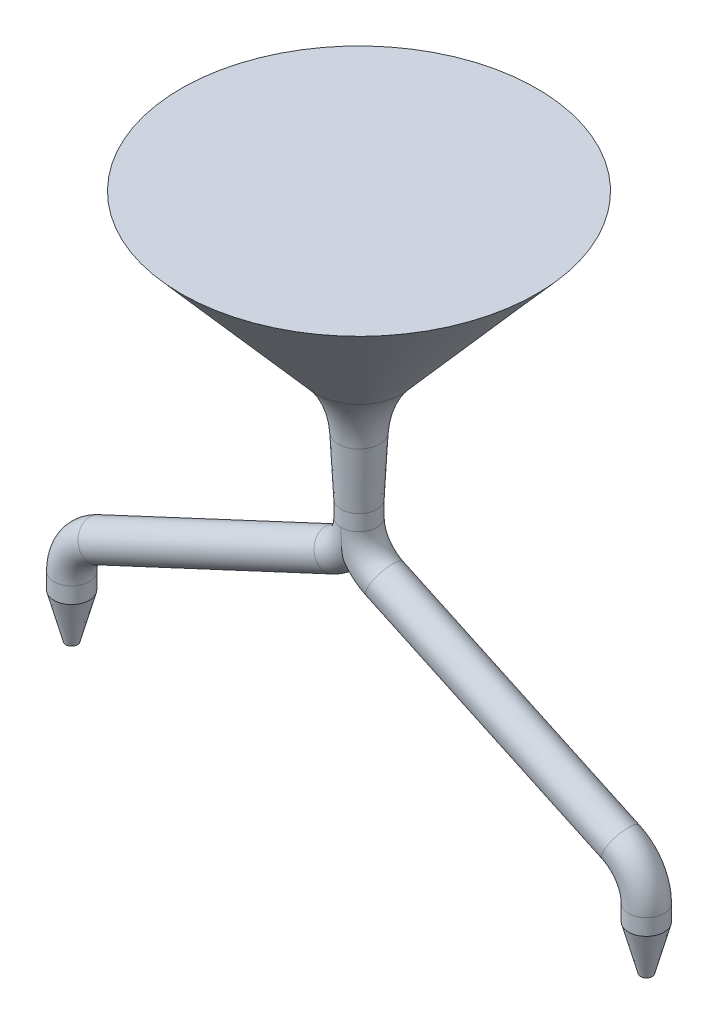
ISO-10303-21;
HEADER;
FILE_DESCRIPTION(('STEP AP214'),'2;1');
FILE_NAME('part.step','',(''),(''),'','','');
FILE_SCHEMA(('AUTOMOTIVE_DESIGN { 1 0 10303 214 1 1 1 1 }'));
ENDSEC;
DATA;
#1=APPLICATION_CONTEXT('core data for automotive mechanical design processes');
#2=APPLICATION_PROTOCOL_DEFINITION('international standard','automotive_design',2000,#1);
#3=PRODUCT_CONTEXT('',#1,'mechanical');
#4=PRODUCT('Part','Part','',(#3));
#5=PRODUCT_RELATED_PRODUCT_CATEGORY('part','',(#4));
#6=PRODUCT_DEFINITION_FORMATION('','',#4);
#7=PRODUCT_DEFINITION_CONTEXT('part definition',#1,'design');
#8=PRODUCT_DEFINITION('design','',#6,#7);
#9=PRODUCT_DEFINITION_SHAPE('','',#8);
#10=(LENGTH_UNIT() NAMED_UNIT(*) SI_UNIT(.MILLI.,.METRE.));
#11=(NAMED_UNIT(*) PLANE_ANGLE_UNIT() SI_UNIT($,.RADIAN.));
#12=(NAMED_UNIT(*) SI_UNIT($,.STERADIAN.) SOLID_ANGLE_UNIT());
#13=UNCERTAINTY_MEASURE_WITH_UNIT(LENGTH_MEASURE(1.E-05),#10,'distance_accuracy_value','');
#14=(GEOMETRIC_REPRESENTATION_CONTEXT(3) GLOBAL_UNCERTAINTY_ASSIGNED_CONTEXT((#13)) GLOBAL_UNIT_ASSIGNED_CONTEXT((#10,
#11,#12)) REPRESENTATION_CONTEXT('',''));
#15=CARTESIAN_POINT('',(0.,0.,0.));
#16=DIRECTION('',(0.,0.,1.));
#17=DIRECTION('',(1.,0.,0.));
#18=AXIS2_PLACEMENT_3D('',#15,#16,#17);
#19=CARTESIAN_POINT('',(5.,-1.74824826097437,0.));
#20=DIRECTION('',(0.,0.,-1.));
#21=DIRECTION('',(-1.,0.,0.));
#22=AXIS2_PLACEMENT_3D('',#19,#20,#21);
#23=TOROIDAL_SURFACE('',#22,5.,2.);
#24=CARTESIAN_POINT('',(2.88690869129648,-6.27978719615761,0.));
#25=DIRECTION('',(0.906307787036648,-0.422618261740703,0.));
#26=DIRECTION('',(0.,0.,-1.));
#27=AXIS2_PLACEMENT_3D('',#24,#25,#26);
#28=CIRCLE('',#27,2.);
#29=CARTESIAN_POINT('',(2.88690869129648,-6.27978719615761,-2.));
#30=VERTEX_POINT('',#29);
#31=EDGE_CURVE('E66',#30,#30,#28,.T.);
#32=ORIENTED_EDGE('',*,*,#31,.F.);
#33=EDGE_LOOP('',(#32));
#34=FACE_BOUND('',#33,.T.);
#35=CARTESIAN_POINT('',(0.,-1.74824826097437,-2.));
#36=CARTESIAN_POINT('',(0.,-1.76491263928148,-2.00000007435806));
#37=CARTESIAN_POINT('',(0.,-1.78157701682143,-2.00000004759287));
#38=CARTESIAN_POINT('',(0.,-1.81491034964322,-1.99999992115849));
#39=CARTESIAN_POINT('',(0.,-1.83157930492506,-1.99999982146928));
#40=CARTESIAN_POINT('',(0.,-1.94622306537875,-1.99999933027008));
#41=CARTESIAN_POINT('',(0.,-2.04419789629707,-1.99999988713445));
#42=CARTESIAN_POINT('',(0.,-2.24014772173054,-1.99988008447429));
#43=CARTESIAN_POINT('',(0.,-2.33812271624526,-1.99975972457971));
#44=CARTESIAN_POINT('',(0.,-2.53410329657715,-1.99913119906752));
#45=CARTESIAN_POINT('',(0.,-2.63210888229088,-1.99862291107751));
#46=CARTESIAN_POINT('',(0.,-2.82811225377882,-1.99681498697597));
#47=CARTESIAN_POINT('',(0.,-2.92611003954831,-1.99551535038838));
#48=CARTESIAN_POINT('',(0.,-3.21978547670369,-1.98969301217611));
#49=CARTESIAN_POINT('',(0.,-3.41543836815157,-1.98324875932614));
#50=CARTESIAN_POINT('',(0.,-3.80608736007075,-1.96002484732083));
#51=CARTESIAN_POINT('',(0.,-4.00108387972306,-1.94325405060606));
#52=CARTESIAN_POINT('',(0.,-4.36222322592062,-1.8963607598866));
#53=CARTESIAN_POINT('',(0.,-4.52863102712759,-1.86840257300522));
#54=CARTESIAN_POINT('',(0.,-4.8581324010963,-1.79510890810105));
#55=CARTESIAN_POINT('',(0.,-5.02122030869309,-1.74974598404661));
#56=CARTESIAN_POINT('',(0.,-5.26114853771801,-1.66435928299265));
#57=CARTESIAN_POINT('',(0.,-5.34094957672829,-1.63268693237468));
#58=CARTESIAN_POINT('',(0.,-5.49765491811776,-1.5628736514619));
#59=CARTESIAN_POINT('',(0.,-5.57455850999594,-1.52473114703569));
#60=CARTESIAN_POINT('',(0.,-5.79887768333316,-1.39981982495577));
#61=CARTESIAN_POINT('',(0.,-5.94079647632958,-1.30227155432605));
#62=CARTESIAN_POINT('',(0.,-6.14106076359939,-1.12521967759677));
#63=CARTESIAN_POINT('',(0.,-6.20888989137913,-1.05635227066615));
#64=CARTESIAN_POINT('',(0.,-6.332977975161,-0.908747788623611));
#65=CARTESIAN_POINT('',(0.,-6.38924037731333,-0.830013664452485));
#66=CARTESIAN_POINT('',(0.,-6.48749826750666,-0.66302938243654));
#67=CARTESIAN_POINT('',(0.,-6.52936100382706,-0.574700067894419));
#68=CARTESIAN_POINT('',(0.,-6.5950710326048,-0.391555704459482));
#69=CARTESIAN_POINT('',(0.,-6.61893596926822,-0.29674710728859));
#70=CARTESIAN_POINT('',(0.,-6.64492372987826,-0.116600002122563));
#71=CARTESIAN_POINT('',(0.,-6.64943817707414,-0.0316023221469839));
#72=CARTESIAN_POINT('',(0.,-6.64300286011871,0.137791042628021));
#73=CARTESIAN_POINT('',(0.,-6.63205770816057,0.222186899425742));
#74=CARTESIAN_POINT('',(0.,-6.5966878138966,0.382122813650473));
#75=CARTESIAN_POINT('',(0.,-6.57321459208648,0.457877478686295));
#76=CARTESIAN_POINT('',(0.,-6.51474368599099,0.604762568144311));
#77=CARTESIAN_POINT('',(0.,-6.47974497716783,0.675892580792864));
#78=CARTESIAN_POINT('',(0.,-6.39686253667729,0.817383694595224));
#79=CARTESIAN_POINT('',(0.,-6.34821388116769,0.887293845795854));
#80=CARTESIAN_POINT('',(0.,-6.24160323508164,1.01956877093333));
#81=CARTESIAN_POINT('',(0.,-6.18363526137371,1.08192865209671));
#82=CARTESIAN_POINT('',(0.,-6.02663330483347,1.23084411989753));
#83=CARTESIAN_POINT('',(0.,-5.92246712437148,1.31200298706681));
#84=CARTESIAN_POINT('',(0.,-5.70259183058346,1.45666264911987));
#85=CARTESIAN_POINT('',(0.,-5.58685872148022,1.52012565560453));
#86=CARTESIAN_POINT('',(0.,-5.27693315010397,1.66470290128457));
#87=CARTESIAN_POINT('',(0.,-5.07713996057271,1.7337447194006));
#88=CARTESIAN_POINT('',(0.,-4.77193614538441,1.81488084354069));
#89=CARTESIAN_POINT('',(0.,-4.66909726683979,1.83820956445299));
#90=CARTESIAN_POINT('',(0.,-4.46218410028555,1.87860393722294));
#91=CARTESIAN_POINT('',(0.,-4.35811006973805,1.89567087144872));
#92=CARTESIAN_POINT('',(0.,-4.05494760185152,1.93781864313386));
#93=CARTESIAN_POINT('',(0.,-3.85496308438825,1.95620992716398));
#94=CARTESIAN_POINT('',(0.,-3.45424946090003,1.98167448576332));
#95=CARTESIAN_POINT('',(0.,-3.25351983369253,1.98873716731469));
#96=CARTESIAN_POINT('',(0.,-2.95237258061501,1.99510788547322));
#97=CARTESIAN_POINT('',(0.,-2.85198595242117,1.99652760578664));
#98=CARTESIAN_POINT('',(0.,-2.65120362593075,1.99850156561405));
#99=CARTESIAN_POINT('',(0.,-2.55080792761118,1.99905580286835));
#100=CARTESIAN_POINT('',(0.,-2.35005149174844,1.99974032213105));
#101=CARTESIAN_POINT('',(0.,-2.24969075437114,1.99987075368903));
#102=CARTESIAN_POINT('',(0.,-2.04896942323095,2.00000026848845));
#103=CARTESIAN_POINT('',(0.,-1.94860882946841,1.99999935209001));
#104=CARTESIAN_POINT('',(0.,-1.83158021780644,1.9999998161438));
#105=CARTESIAN_POINT('',(0.,-1.81491217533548,1.99999991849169));
#106=CARTESIAN_POINT('',(0.,-1.78157884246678,2.00000005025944));
#107=CARTESIAN_POINT('',(0.,-1.76491355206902,2.00000007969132));
#108=CARTESIAN_POINT('',(0.,-1.74824826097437,2.));
#109=B_SPLINE_CURVE_WITH_KNOTS('',3,(#35,#36,#37,#38,#39,#40,#41,#42,#43,#44,#45,#46,#47,#48,
#49,#50,#51,#52,#53,#54,#55,#56,#57,#58,#59,#60,#61,#62,#63,#64,#65,#66,#67,#68,#69,#70,#71,#72,
#73,#74,#75,#76,#77,#78,#79,#80,#81,#82,#83,#84,#85,#86,#87,#88,#89,#90,#91,#92,#93,#94,#95,#96,
#97,#98,#99,#100,#101,#102,#103,#104,#105,#106,#107,#108),.UNSPECIFIED.,.F.,.F.,(4,2,2,2,2,2,2,
2,2,2,2,2,2,2,2,2,2,2,2,2,2,2,2,2,2,2,2,2,2,2,2,2,2,2,2,2,4),(0.,0.0499931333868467,
0.100000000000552,0.393924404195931,0.687849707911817,0.98186776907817,1.27588600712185,
1.86304315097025,2.44969708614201,2.95531481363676,3.46173316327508,3.7190251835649,
3.9763798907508,4.48829664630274,4.77732245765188,5.06626203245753,5.35779813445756,
5.64904805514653,5.90302476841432,6.15692572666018,6.39382797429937,6.6307512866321,
6.88530195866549,7.14001671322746,7.53390486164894,7.92862780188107,8.55894206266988,
8.87521074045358,9.19141461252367,9.79328329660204,10.3957144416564,10.6969024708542,
10.9980912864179,11.2991738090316,11.6002555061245,11.6502596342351,11.7002555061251),.UNSPECIFIED.);
#110=CARTESIAN_POINT('',(0.,-1.74824826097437,-2.));
#111=VERTEX_POINT('',#110);
#112=CARTESIAN_POINT('',(0.,-1.74824826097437,2.));
#113=VERTEX_POINT('',#112);
#114=EDGE_CURVE('E60',#111,#113,#109,.T.);
#115=ORIENTED_EDGE('',*,*,#114,.F.);
#116=CARTESIAN_POINT('',(0.,-1.74824826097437,0.));
#117=DIRECTION('',(0.,-1.,0.));
#118=DIRECTION('',(0.,0.,-1.));
#119=AXIS2_PLACEMENT_3D('',#116,#117,#118);
#120=CIRCLE('',#119,2.);
#121=EDGE_CURVE('E53',#111,#113,#120,.T.);
#122=ORIENTED_EDGE('',*,*,#121,.T.);
#123=EDGE_LOOP('',(#115,#122));
#124=FACE_BOUND('',#123,.T.);
#125=ADVANCED_FACE('F35',(#34,#124),#23,.T.);
#126=CARTESIAN_POINT('',(20.,30.,0.));
#127=DIRECTION('',(0.,1.,0.));
#128=DIRECTION('',(0.,0.,1.));
#129=AXIS2_PLACEMENT_3D('',#126,#127,#128);
#130=PLANE('',#129);
#131=CARTESIAN_POINT('',(0.,30.,0.));
#132=DIRECTION('',(0.,-1.,0.));
#133=DIRECTION('',(0.,0.,-1.));
#134=AXIS2_PLACEMENT_3D('',#131,#132,#133);
#135=CIRCLE('',#134,20.);
#136=CARTESIAN_POINT('',(0.,30.,20.));
#137=VERTEX_POINT('',#136);
#138=EDGE_CURVE('E72',#137,#137,#135,.T.);
#139=ORIENTED_EDGE('',*,*,#138,.F.);
#140=EDGE_LOOP('',(#139));
#141=FACE_BOUND('',#140,.T.);
#142=ADVANCED_FACE('F116',(#141),#130,.T.);
#143=CARTESIAN_POINT('',(0.,10.,0.));
#144=DIRECTION('',(0.,1.,0.));
#145=DIRECTION('',(0.,0.,1.));
#146=AXIS2_PLACEMENT_3D('',#143,#144,#145);
#147=CONICAL_SURFACE('',#146,2.5,0.718829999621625);
#148=CARTESIAN_POINT('',(0.,12.6151187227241,0.));
#149=DIRECTION('',(0.,1.,0.));
#150=DIRECTION('',(0.,0.,1.));
#151=AXIS2_PLACEMENT_3D('',#148,#149,#150);
#152=CIRCLE('',#151,4.78822888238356);
#153=CARTESIAN_POINT('',(0.,12.6151187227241,4.78822888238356));
#154=VERTEX_POINT('',#153);
#155=EDGE_CURVE('E11',#154,#154,#152,.T.);
#156=CARTESIAN_POINT('',(0.,12.6151187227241,4.78822888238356));
#157=CARTESIAN_POINT('',(0.,12.796211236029,4.9466848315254));
#158=CARTESIAN_POINT('',(0.,12.977303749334,5.10514078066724));
#159=CARTESIAN_POINT('',(0.,13.3394887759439,5.42205267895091));
#160=CARTESIAN_POINT('',(0.,13.5205812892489,5.58050862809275));
#161=CARTESIAN_POINT('',(0.,13.8827663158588,5.89742052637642));
#162=CARTESIAN_POINT('',(0.,14.0638588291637,6.05587647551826));
#163=CARTESIAN_POINT('',(0.,14.4260438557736,6.37278837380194));
#164=CARTESIAN_POINT('',(0.,14.6071363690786,6.53124432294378));
#165=CARTESIAN_POINT('',(0.,14.9693213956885,6.84815622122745));
#166=CARTESIAN_POINT('',(0.,15.1504139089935,7.00661217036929));
#167=CARTESIAN_POINT('',(0.,15.5125989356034,7.32352406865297));
#168=CARTESIAN_POINT('',(0.,15.6936914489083,7.4819800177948));
#169=CARTESIAN_POINT('',(0.,16.0558764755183,7.79889191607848));
#170=CARTESIAN_POINT('',(0.,16.2369689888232,7.95734786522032));
#171=CARTESIAN_POINT('',(0.,16.5991540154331,8.27425976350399));
#172=CARTESIAN_POINT('',(0.,16.7802465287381,8.43271571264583));
#173=CARTESIAN_POINT('',(0.,17.142431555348,8.74962761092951));
#174=CARTESIAN_POINT('',(0.,17.323524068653,8.90808356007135));
#175=CARTESIAN_POINT('',(0.,17.6857090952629,9.22499545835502));
#176=CARTESIAN_POINT('',(0.,17.8668016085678,9.38345140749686));
#177=CARTESIAN_POINT('',(0.,18.2289866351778,9.70036330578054));
#178=CARTESIAN_POINT('',(0.,18.4100791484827,9.85881925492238));
#179=CARTESIAN_POINT('',(0.,18.7722641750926,10.1757311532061));
#180=CARTESIAN_POINT('',(0.,18.9533566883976,10.3341871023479));
#181=CARTESIAN_POINT('',(0.,19.3155417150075,10.6510990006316));
#182=CARTESIAN_POINT('',(0.,19.4966342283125,10.8095549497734));
#183=CARTESIAN_POINT('',(0.,19.8588192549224,11.1264668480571));
#184=CARTESIAN_POINT('',(0.,20.0399117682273,11.2849227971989));
#185=CARTESIAN_POINT('',(0.,20.4020967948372,11.6018346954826));
#186=CARTESIAN_POINT('',(0.,20.5831893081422,11.7602906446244));
#187=CARTESIAN_POINT('',(0.,20.9453743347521,12.0772025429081));
#188=CARTESIAN_POINT('',(0.,21.1264668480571,12.2356584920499));
#189=CARTESIAN_POINT('',(0.,21.488651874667,12.5525703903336));
#190=CARTESIAN_POINT('',(0.,21.6697443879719,12.7110263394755));
#191=CARTESIAN_POINT('',(0.,22.0319294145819,13.0279382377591));
#192=CARTESIAN_POINT('',(0.,22.2130219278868,13.186394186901));
#193=CARTESIAN_POINT('',(0.,22.5752069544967,13.5033060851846));
#194=CARTESIAN_POINT('',(0.,22.7562994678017,13.6617620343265));
#195=CARTESIAN_POINT('',(0.,23.1184844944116,13.9786739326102));
#196=CARTESIAN_POINT('',(0.,23.2995770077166,14.137129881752));
#197=CARTESIAN_POINT('',(0.,23.6617620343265,14.4540417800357));
#198=CARTESIAN_POINT('',(0.,23.8428545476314,14.6124977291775));
#199=CARTESIAN_POINT('',(0.,24.2050395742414,14.9294096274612));
#200=CARTESIAN_POINT('',(0.,24.3861320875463,15.087865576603));
#201=CARTESIAN_POINT('',(0.,24.7483171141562,15.4047774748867));
#202=CARTESIAN_POINT('',(0.,24.9294096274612,15.5632334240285));
#203=CARTESIAN_POINT('',(0.,25.2915946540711,15.8801453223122));
#204=CARTESIAN_POINT('',(0.,25.4726871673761,16.0386012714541));
#205=CARTESIAN_POINT('',(0.,25.834872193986,16.3555131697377));
#206=CARTESIAN_POINT('',(0.,26.0159647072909,16.5139691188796));
#207=CARTESIAN_POINT('',(0.,26.3781497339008,16.8308810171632));
#208=CARTESIAN_POINT('',(0.,26.5592422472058,16.9893369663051));
#209=CARTESIAN_POINT('',(0.,26.9214272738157,17.3062488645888));
#210=CARTESIAN_POINT('',(0.,27.1025197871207,17.4647048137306));
#211=CARTESIAN_POINT('',(0.,27.4647048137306,17.7816167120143));
#212=CARTESIAN_POINT('',(0.,27.6457973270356,17.9400726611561));
#213=CARTESIAN_POINT('',(0.,28.0079823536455,18.2569845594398));
#214=CARTESIAN_POINT('',(0.,28.1890748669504,18.4154405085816));
#215=CARTESIAN_POINT('',(0.,28.5512598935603,18.7323524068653));
#216=CARTESIAN_POINT('',(0.,28.7323524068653,18.8908083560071));
#217=CARTESIAN_POINT('',(0.,29.0945374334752,19.2077202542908));
#218=CARTESIAN_POINT('',(0.,29.2756299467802,19.3661762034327));
#219=CARTESIAN_POINT('',(0.,29.6378149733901,19.6830881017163));
#220=CARTESIAN_POINT('',(0.,29.818907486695,19.8415440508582));
#221=CARTESIAN_POINT('',(0.,30.,20.));
#222=B_SPLINE_CURVE_WITH_KNOTS('',3,(#156,#157,#158,#159,#160,#161,#162,#163,#164,#165,#166,
#167,#168,#169,#170,#171,#172,#173,#174,#175,#176,#177,#178,#179,#180,#181,#182,#183,#184,#185,
#186,#187,#188,#189,#190,#191,#192,#193,#194,#195,#196,#197,#198,#199,#200,#201,#202,#203,#204,
#205,#206,#207,#208,#209,#210,#211,#212,#213,#214,#215,#216,#217,#218,#219,#220,#221),
.UNSPECIFIED.,.F.,.F.,(4,2,2,2,2,2,2,2,2,2,2,2,2,2,2,2,2,2,2,2,2,2,2,2,2,2,2,2,2,2,2,2,4),(0.,
0.721889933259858,1.44377986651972,2.16566979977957,2.88755973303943,3.60944966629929,
4.33133959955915,5.05322953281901,5.77511946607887,6.49700939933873,7.21889933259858,
7.94078926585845,8.6626791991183,9.38456913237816,10.106459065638,10.8283489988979,
11.5502389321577,12.2721288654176,12.9940187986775,13.7159087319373,14.4377986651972,
15.159688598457,15.8815785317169,16.6034684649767,17.3253583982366,18.0472483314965,
18.7691382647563,19.4910281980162,20.212918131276,20.9348080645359,21.6566979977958,
22.3785879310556,23.1004778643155),.UNSPECIFIED.);
#223=EDGE_CURVE('BSEAM121',#154,#137,#222,.T.);
#224=ORIENTED_EDGE('',*,*,#155,.T.);
#225=ORIENTED_EDGE('',*,*,#138,.T.);
#226=ORIENTED_EDGE('',*,*,#223,.T.);
#227=ORIENTED_EDGE('',*,*,#223,.F.);
#228=EDGE_LOOP('',(#224,#226,#225,#227));
#229=FACE_BOUND('',#228,.T.);
#230=ADVANCED_FACE('F121',(#229),#147,.T.);
#231=CARTESIAN_POINT('',(0.,0.,0.));
#232=DIRECTION('',(0.,1.,0.));
#233=DIRECTION('',(0.,0.,1.));
#234=AXIS2_PLACEMENT_3D('',#231,#232,#233);
#235=CONICAL_SURFACE('',#234,2.,0.0499583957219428);
#236=CARTESIAN_POINT('',(0.,6.52944881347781,0.));
#237=DIRECTION('',(0.,1.,0.));
#238=DIRECTION('',(0.,0.,1.));
#239=AXIS2_PLACEMENT_3D('',#236,#237,#238);
#240=CIRCLE('',#239,2.32647244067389);
#241=CARTESIAN_POINT('',(0.,6.52944881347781,2.32647244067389));
#242=VERTEX_POINT('',#241);
#243=EDGE_CURVE('E44',#242,#242,#240,.F.);
#244=ORIENTED_EDGE('',*,*,#243,.T.);
#245=EDGE_LOOP('',(#244));
#246=FACE_BOUND('',#245,.T.);
#247=CARTESIAN_POINT('',(0.,0.,0.));
#248=DIRECTION('',(0.,-1.,0.));
#249=DIRECTION('',(0.,0.,-1.));
#250=AXIS2_PLACEMENT_3D('',#247,#248,#249);
#251=CIRCLE('',#250,2.);
#252=CARTESIAN_POINT('',(0.,0.,-2.));
#253=VERTEX_POINT('',#252);
#254=EDGE_CURVE('E58',#253,#253,#251,.T.);
#255=ORIENTED_EDGE('',*,*,#254,.F.);
#256=EDGE_LOOP('',(#255));
#257=FACE_BOUND('',#256,.T.);
#258=ADVANCED_FACE('F112',(#246,#257),#235,.T.);
#259=CARTESIAN_POINT('',(32.31,-25.,0.));
#260=DIRECTION('',(0.,1.,0.));
#261=DIRECTION('',(0.,0.,1.));
#262=AXIS2_PLACEMENT_3D('',#259,#260,#261);
#263=CYLINDRICAL_SURFACE('',#262,2.);
#264=CARTESIAN_POINT('',(32.31,-23.1853513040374,0.));
#265=DIRECTION('',(0.,-1.,0.));
#266=DIRECTION('',(0.,0.,-1.));
#267=AXIS2_PLACEMENT_3D('',#264,#265,#266);
#268=CIRCLE('',#267,2.);
#269=CARTESIAN_POINT('',(34.31,-23.1853513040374,0.));
#270=VERTEX_POINT('',#269);
#271=EDGE_CURVE('E80',#270,#270,#268,.T.);
#272=ORIENTED_EDGE('',*,*,#271,.T.);
#273=EDGE_LOOP('',(#272));
#274=FACE_BOUND('',#273,.T.);
#275=CARTESIAN_POINT('',(32.31,-25.,0.));
#276=DIRECTION('',(0.,-1.,0.));
#277=DIRECTION('',(0.,0.,-1.));
#278=AXIS2_PLACEMENT_3D('',#275,#276,#277);
#279=CIRCLE('',#278,2.);
#280=CARTESIAN_POINT('',(32.31,-25.,-2.));
#281=VERTEX_POINT('',#280);
#282=EDGE_CURVE('E78',#281,#281,#279,.T.);
#283=ORIENTED_EDGE('',*,*,#282,.F.);
#284=EDGE_LOOP('',(#283));
#285=FACE_BOUND('',#284,.T.);
#286=ADVANCED_FACE('F113',(#274,#285),#263,.T.);
#287=CARTESIAN_POINT('',(27.31,-23.1853513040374,0.));
#288=DIRECTION('',(0.,0.,1.));
#289=DIRECTION('',(1.,0.,0.));
#290=AXIS2_PLACEMENT_3D('',#287,#288,#289);
#291=TOROIDAL_SURFACE('',#290,5.,2.);
#292=CARTESIAN_POINT('',(29.4230913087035,-18.6538123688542,0.));
#293=DIRECTION('',(0.906307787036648,-0.422618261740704,0.));
#294=DIRECTION('',(0.,0.,-1.));
#295=AXIS2_PLACEMENT_3D('',#292,#293,#294);
#296=CIRCLE('',#295,2.);
#297=CARTESIAN_POINT('',(30.2683278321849,-16.8411967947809,0.));
#298=VERTEX_POINT('',#297);
#299=EDGE_CURVE('E68',#298,#298,#296,.T.);
#300=CARTESIAN_POINT('',(27.31,-23.1853513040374,0.));
#301=DIRECTION('',(0.,0.,1.));
#302=DIRECTION('',(1.,0.,0.));
#303=AXIS2_PLACEMENT_3D('',#300,#301,#302);
#304=CIRCLE('',#303,7.);
#305=EDGE_CURVE('',#270,#298,#304,.T.);
#306=ORIENTED_EDGE('',*,*,#271,.F.);
#307=ORIENTED_EDGE('',*,*,#299,.T.);
#308=ORIENTED_EDGE('',*,*,#305,.T.);
#309=ORIENTED_EDGE('',*,*,#305,.F.);
#310=EDGE_LOOP('',(#306,#308,#307,#309));
#311=FACE_BOUND('',#310,.T.);
#312=ADVANCED_FACE('F99',(#311),#291,.T.);
#313=CARTESIAN_POINT('',(29.4230913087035,-18.6538123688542,0.));
#314=DIRECTION('',(-0.906307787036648,0.422618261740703,0.));
#315=DIRECTION('',(-0.422618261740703,-0.906307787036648,0.));
#316=AXIS2_PLACEMENT_3D('',#313,#314,#315);
#317=CYLINDRICAL_SURFACE('',#316,2.);
#318=ORIENTED_EDGE('',*,*,#31,.T.);
#319=EDGE_LOOP('',(#318));
#320=FACE_BOUND('',#319,.T.);
#321=ORIENTED_EDGE('',*,*,#299,.F.);
#322=EDGE_LOOP('',(#321));
#323=FACE_BOUND('',#322,.T.);
#324=ADVANCED_FACE('F102',(#320,#323),#317,.T.);
#325=CARTESIAN_POINT('',(0.,-1.74824826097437,0.));
#326=DIRECTION('',(0.,1.,0.));
#327=DIRECTION('',(0.,0.,1.));
#328=AXIS2_PLACEMENT_3D('',#325,#326,#327);
#329=CYLINDRICAL_SURFACE('',#328,2.);
#330=ORIENTED_EDGE('',*,*,#254,.T.);
#331=EDGE_LOOP('',(#330));
#332=FACE_BOUND('',#331,.T.);
#333=ORIENTED_EDGE('',*,*,#121,.F.);
#334=EDGE_CURVE('E51',#113,#111,#120,.T.);
#335=ORIENTED_EDGE('',*,*,#334,.F.);
#336=EDGE_LOOP('',(#333,#335));
#337=FACE_BOUND('',#336,.T.);
#338=ADVANCED_FACE('F55',(#332,#337),#329,.T.);
#339=CARTESIAN_POINT('',(0.,6.03007264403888,0.));
#340=DIRECTION('',(0.,-1.,0.));
#341=DIRECTION('',(0.,0.,-1.));
#342=AXIS2_PLACEMENT_3D('',#339,#340,#341);
#343=TOROIDAL_SURFACE('',#342,12.3139958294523,10.);
#344=ORIENTED_EDGE('',*,*,#155,.F.);
#345=EDGE_LOOP('',(#344));
#346=FACE_BOUND('',#345,.T.);
#347=ORIENTED_EDGE('',*,*,#243,.F.);
#348=EDGE_LOOP('',(#347));
#349=FACE_BOUND('',#348,.T.);
#350=ADVANCED_FACE('F37',(#346,#349),#343,.F.);
#351=CARTESIAN_POINT('',(32.31,-25.,0.));
#352=DIRECTION('',(0.,1.,0.));
#353=DIRECTION('',(0.,0.,-1.));
#354=AXIS2_PLACEMENT_3D('',#351,#352,#353);
#355=CONICAL_SURFACE('',#354,2.,0.26179938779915);
#356=CARTESIAN_POINT('',(32.31,-30.,0.));
#357=DIRECTION('',(0.,-1.,0.));
#358=DIRECTION('',(0.,0.,-1.));
#359=AXIS2_PLACEMENT_3D('',#356,#357,#358);
#360=CIRCLE('',#359,0.660254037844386);
#361=CARTESIAN_POINT('',(32.31,-30.,-0.660254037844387));
#362=VERTEX_POINT('',#361);
#363=EDGE_CURVE('E62',#362,#362,#360,.T.);
#364=CARTESIAN_POINT('',(32.31,-30.,-0.660254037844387));
#365=CARTESIAN_POINT('',(32.31,-29.9479166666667,-0.674209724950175));
#366=CARTESIAN_POINT('',(32.31,-29.8958333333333,-0.688165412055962));
#367=CARTESIAN_POINT('',(32.31,-29.7916666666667,-0.716076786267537));
#368=CARTESIAN_POINT('',(32.31,-29.7395833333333,-0.730032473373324));
#369=CARTESIAN_POINT('',(32.31,-29.6354166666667,-0.7579438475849));
#370=CARTESIAN_POINT('',(32.31,-29.5833333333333,-0.771899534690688));
#371=CARTESIAN_POINT('',(32.31,-29.4791666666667,-0.799810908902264));
#372=CARTESIAN_POINT('',(32.31,-29.4270833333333,-0.813766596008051));
#373=CARTESIAN_POINT('',(32.31,-29.3229166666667,-0.841677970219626));
#374=CARTESIAN_POINT('',(32.31,-29.2708333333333,-0.855633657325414));
#375=CARTESIAN_POINT('',(32.31,-29.1666666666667,-0.883545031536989));
#376=CARTESIAN_POINT('',(32.31,-29.1145833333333,-0.897500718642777));
#377=CARTESIAN_POINT('',(32.31,-29.0104166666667,-0.925412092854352));
#378=CARTESIAN_POINT('',(32.31,-28.9583333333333,-0.93936777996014));
#379=CARTESIAN_POINT('',(32.31,-28.8541666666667,-0.967279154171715));
#380=CARTESIAN_POINT('',(32.31,-28.8020833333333,-0.981234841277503));
#381=CARTESIAN_POINT('',(32.31,-28.6979166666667,-1.00914621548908));
#382=CARTESIAN_POINT('',(32.31,-28.6458333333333,-1.02310190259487));
#383=CARTESIAN_POINT('',(32.31,-28.5416666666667,-1.05101327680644));
#384=CARTESIAN_POINT('',(32.31,-28.4895833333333,-1.06496896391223));
#385=CARTESIAN_POINT('',(32.31,-28.3854166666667,-1.0928803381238));
#386=CARTESIAN_POINT('',(32.31,-28.3333333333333,-1.10683602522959));
#387=CARTESIAN_POINT('',(32.31,-28.2291666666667,-1.13474739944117));
#388=CARTESIAN_POINT('',(32.31,-28.1770833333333,-1.14870308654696));
#389=CARTESIAN_POINT('',(32.31,-28.0729166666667,-1.17661446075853));
#390=CARTESIAN_POINT('',(32.31,-28.0208333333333,-1.19057014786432));
#391=CARTESIAN_POINT('',(32.31,-27.9166666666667,-1.21848152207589));
#392=CARTESIAN_POINT('',(32.31,-27.8645833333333,-1.23243720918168));
#393=CARTESIAN_POINT('',(32.31,-27.7604166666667,-1.26034858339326));
#394=CARTESIAN_POINT('',(32.31,-27.7083333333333,-1.27430427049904));
#395=CARTESIAN_POINT('',(32.31,-27.6041666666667,-1.30221564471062));
#396=CARTESIAN_POINT('',(32.31,-27.5520833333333,-1.31617133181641));
#397=CARTESIAN_POINT('',(32.31,-27.4479166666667,-1.34408270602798));
#398=CARTESIAN_POINT('',(32.31,-27.3958333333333,-1.35803839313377));
#399=CARTESIAN_POINT('',(32.31,-27.2916666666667,-1.38594976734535));
#400=CARTESIAN_POINT('',(32.31,-27.2395833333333,-1.39990545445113));
#401=CARTESIAN_POINT('',(32.31,-27.1354166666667,-1.42781682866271));
#402=CARTESIAN_POINT('',(32.31,-27.0833333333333,-1.4417725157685));
#403=CARTESIAN_POINT('',(32.31,-26.9791666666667,-1.46968388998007));
#404=CARTESIAN_POINT('',(32.31,-26.9270833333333,-1.48363957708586));
#405=CARTESIAN_POINT('',(32.31,-26.8229166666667,-1.51155095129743));
#406=CARTESIAN_POINT('',(32.31,-26.7708333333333,-1.52550663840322));
#407=CARTESIAN_POINT('',(32.31,-26.6666666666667,-1.5534180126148));
#408=CARTESIAN_POINT('',(32.31,-26.6145833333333,-1.56737369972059));
#409=CARTESIAN_POINT('',(32.31,-26.5104166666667,-1.59528507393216));
#410=CARTESIAN_POINT('',(32.31,-26.4583333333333,-1.60924076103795));
#411=CARTESIAN_POINT('',(32.31,-26.3541666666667,-1.63715213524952));
#412=CARTESIAN_POINT('',(32.31,-26.3020833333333,-1.65110782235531));
#413=CARTESIAN_POINT('',(32.31,-26.1979166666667,-1.67901919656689));
#414=CARTESIAN_POINT('',(32.31,-26.1458333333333,-1.69297488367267));
#415=CARTESIAN_POINT('',(32.31,-26.0416666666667,-1.72088625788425));
#416=CARTESIAN_POINT('',(32.31,-25.9895833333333,-1.73484194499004));
#417=CARTESIAN_POINT('',(32.31,-25.8854166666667,-1.76275331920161));
#418=CARTESIAN_POINT('',(32.31,-25.8333333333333,-1.7767090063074));
#419=CARTESIAN_POINT('',(32.31,-25.7291666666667,-1.80462038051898));
#420=CARTESIAN_POINT('',(32.31,-25.6770833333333,-1.81857606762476));
#421=CARTESIAN_POINT('',(32.31,-25.5729166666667,-1.84648744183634));
#422=CARTESIAN_POINT('',(32.31,-25.5208333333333,-1.86044312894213));
#423=CARTESIAN_POINT('',(32.31,-25.4166666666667,-1.8883545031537));
#424=CARTESIAN_POINT('',(32.31,-25.3645833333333,-1.90231019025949));
#425=CARTESIAN_POINT('',(32.31,-25.2604166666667,-1.93022156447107));
#426=CARTESIAN_POINT('',(32.31,-25.2083333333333,-1.94417725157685));
#427=CARTESIAN_POINT('',(32.31,-25.1041666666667,-1.97208862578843));
#428=CARTESIAN_POINT('',(32.31,-25.0520833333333,-1.98604431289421));
#429=CARTESIAN_POINT('',(32.31,-25.,-2.));
#430=B_SPLINE_CURVE_WITH_KNOTS('',3,(#364,#365,#366,#367,#368,#369,#370,#371,#372,#373,#374,
#375,#376,#377,#378,#379,#380,#381,#382,#383,#384,#385,#386,#387,#388,#389,#390,#391,#392,#393,
#394,#395,#396,#397,#398,#399,#400,#401,#402,#403,#404,#405,#406,#407,#408,#409,#410,#411,#412,
#413,#414,#415,#416,#417,#418,#419,#420,#421,#422,#423,#424,#425,#426,#427,#428,#429),
.UNSPECIFIED.,.F.,.F.,(4,2,2,2,2,2,2,2,2,2,2,2,2,2,2,2,2,2,2,2,2,2,2,2,2,2,2,2,2,2,2,2,4),(0.,
0.161761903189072,0.323523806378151,0.485285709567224,0.647047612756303,0.808809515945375,
0.97057141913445,1.13233332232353,1.2940952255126,1.45585712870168,1.61761903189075,
1.77938093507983,1.9411428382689,2.10290474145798,2.26466664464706,2.42642854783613,
2.58819045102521,2.74995235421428,2.91171425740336,3.07347616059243,3.23523806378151,
3.39699996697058,3.55876187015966,3.72052377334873,3.88228567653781,4.04404757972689,
4.20580948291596,4.36757138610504,4.52933328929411,4.69109519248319,4.85285709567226,
5.01461899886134,5.17638090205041),.UNSPECIFIED.);
#431=EDGE_CURVE('BSEAM139',#362,#281,#430,.T.);
#432=ORIENTED_EDGE('',*,*,#363,.F.);
#433=ORIENTED_EDGE('',*,*,#282,.T.);
#434=ORIENTED_EDGE('',*,*,#431,.T.);
#435=ORIENTED_EDGE('',*,*,#431,.F.);
#436=EDGE_LOOP('',(#432,#434,#433,#435));
#437=FACE_BOUND('',#436,.T.);
#438=ADVANCED_FACE('F139',(#437),#355,.T.);
#439=CARTESIAN_POINT('',(32.31,-30.,0.));
#440=DIRECTION('',(0.,-1.,0.));
#441=DIRECTION('',(0.,0.,-1.));
#442=AXIS2_PLACEMENT_3D('',#439,#440,#441);
#443=PLANE('',#442);
#444=ORIENTED_EDGE('',*,*,#363,.T.);
#445=EDGE_LOOP('',(#444));
#446=FACE_BOUND('',#445,.T.);
#447=ADVANCED_FACE('F146',(#446),#443,.T.);
#448=CARTESIAN_POINT('',(-5.,-1.74824826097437,0.));
#449=DIRECTION('',(0.,0.,1.));
#450=DIRECTION('',(1.,0.,0.));
#451=AXIS2_PLACEMENT_3D('',#448,#449,#450);
#452=TOROIDAL_SURFACE('',#451,5.,2.);
#453=CARTESIAN_POINT('',(-2.88690869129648,-6.27978719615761,0.));
#454=DIRECTION('',(0.906307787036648,0.422618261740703,0.));
#455=DIRECTION('',(0.,0.,-1.));
#456=AXIS2_PLACEMENT_3D('',#453,#454,#455);
#457=CIRCLE('',#456,2.);
#458=CARTESIAN_POINT('',(-2.88690869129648,-6.27978719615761,-2.));
#459=VERTEX_POINT('',#458);
#460=EDGE_CURVE('E63',#459,#459,#457,.F.);
#461=ORIENTED_EDGE('',*,*,#460,.F.);
#462=EDGE_LOOP('',(#461));
#463=FACE_BOUND('',#462,.T.);
#464=ORIENTED_EDGE('',*,*,#334,.T.);
#465=ORIENTED_EDGE('',*,*,#114,.T.);
#466=EDGE_LOOP('',(#464,#465));
#467=FACE_BOUND('',#466,.T.);
#468=ADVANCED_FACE('F65',(#463,#467),#452,.T.);
#469=CARTESIAN_POINT('',(-32.31,-25.,0.));
#470=DIRECTION('',(0.,1.,0.));
#471=DIRECTION('',(0.,0.,1.));
#472=AXIS2_PLACEMENT_3D('',#469,#470,#471);
#473=CYLINDRICAL_SURFACE('',#472,2.);
#474=CARTESIAN_POINT('',(-32.31,-23.1853513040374,0.));
#475=DIRECTION('',(0.,1.,0.));
#476=DIRECTION('',(0.,0.,-1.));
#477=AXIS2_PLACEMENT_3D('',#474,#475,#476);
#478=CIRCLE('',#477,2.);
#479=CARTESIAN_POINT('',(-34.31,-23.1853513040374,0.));
#480=VERTEX_POINT('',#479);
#481=EDGE_CURVE('E187',#480,#480,#478,.F.);
#482=ORIENTED_EDGE('',*,*,#481,.T.);
#483=EDGE_LOOP('',(#482));
#484=FACE_BOUND('',#483,.T.);
#485=CARTESIAN_POINT('',(-32.31,-25.,0.));
#486=DIRECTION('',(0.,1.,0.));
#487=DIRECTION('',(0.,0.,-1.));
#488=AXIS2_PLACEMENT_3D('',#485,#486,#487);
#489=CIRCLE('',#488,2.);
#490=CARTESIAN_POINT('',(-32.31,-25.,-2.));
#491=VERTEX_POINT('',#490);
#492=EDGE_CURVE('E39',#491,#491,#489,.F.);
#493=ORIENTED_EDGE('',*,*,#492,.F.);
#494=EDGE_LOOP('',(#493));
#495=FACE_BOUND('',#494,.T.);
#496=ADVANCED_FACE('F160',(#484,#495),#473,.T.);
#497=CARTESIAN_POINT('',(-27.31,-23.1853513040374,0.));
#498=DIRECTION('',(0.,0.,-1.));
#499=DIRECTION('',(-1.,0.,0.));
#500=AXIS2_PLACEMENT_3D('',#497,#498,#499);
#501=TOROIDAL_SURFACE('',#500,5.,2.);
#502=CARTESIAN_POINT('',(-29.4230913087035,-18.6538123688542,0.));
#503=DIRECTION('',(0.906307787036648,0.422618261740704,0.));
#504=DIRECTION('',(0.,0.,-1.));
#505=AXIS2_PLACEMENT_3D('',#502,#503,#504);
#506=CIRCLE('',#505,2.);
#507=CARTESIAN_POINT('',(-30.2683278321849,-16.8411967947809,0.));
#508=VERTEX_POINT('',#507);
#509=EDGE_CURVE('E191',#508,#508,#506,.F.);
#510=CARTESIAN_POINT('',(-27.31,-23.1853513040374,0.));
#511=DIRECTION('',(0.,0.,-1.));
#512=DIRECTION('',(-1.,0.,0.));
#513=AXIS2_PLACEMENT_3D('',#510,#511,#512);
#514=CIRCLE('',#513,7.);
#515=EDGE_CURVE('',#480,#508,#514,.T.);
#516=ORIENTED_EDGE('',*,*,#481,.F.);
#517=ORIENTED_EDGE('',*,*,#509,.T.);
#518=ORIENTED_EDGE('',*,*,#515,.T.);
#519=ORIENTED_EDGE('',*,*,#515,.F.);
#520=EDGE_LOOP('',(#516,#518,#517,#519));
#521=FACE_BOUND('',#520,.T.);
#522=ADVANCED_FACE('F166',(#521),#501,.T.);
#523=CARTESIAN_POINT('',(-29.4230913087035,-18.6538123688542,0.));
#524=DIRECTION('',(0.906307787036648,0.422618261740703,0.));
#525=DIRECTION('',(-0.422618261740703,0.906307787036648,0.));
#526=AXIS2_PLACEMENT_3D('',#523,#524,#525);
#527=CYLINDRICAL_SURFACE('',#526,2.);
#528=ORIENTED_EDGE('',*,*,#460,.T.);
#529=EDGE_LOOP('',(#528));
#530=FACE_BOUND('',#529,.T.);
#531=ORIENTED_EDGE('',*,*,#509,.F.);
#532=EDGE_LOOP('',(#531));
#533=FACE_BOUND('',#532,.T.);
#534=ADVANCED_FACE('F162',(#530,#533),#527,.T.);
#535=CARTESIAN_POINT('',(-32.31,-25.,0.));
#536=DIRECTION('',(0.,1.,0.));
#537=DIRECTION('',(0.,0.,-1.));
#538=AXIS2_PLACEMENT_3D('',#535,#536,#537);
#539=CONICAL_SURFACE('',#538,2.,0.26179938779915);
#540=CARTESIAN_POINT('',(-32.31,-30.,0.));
#541=DIRECTION('',(0.,-1.,0.));
#542=DIRECTION('',(0.,0.,-1.));
#543=AXIS2_PLACEMENT_3D('',#540,#541,#542);
#544=CIRCLE('',#543,0.660254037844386);
#545=CARTESIAN_POINT('',(-32.31,-30.,-0.660254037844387));
#546=VERTEX_POINT('',#545);
#547=EDGE_CURVE('E184',#546,#546,#544,.F.);
#548=CARTESIAN_POINT('',(-32.31,-30.,-0.660254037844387));
#549=CARTESIAN_POINT('',(-32.31,-29.9479166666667,-0.674209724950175));
#550=CARTESIAN_POINT('',(-32.31,-29.8958333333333,-0.688165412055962));
#551=CARTESIAN_POINT('',(-32.31,-29.7916666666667,-0.716076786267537));
#552=CARTESIAN_POINT('',(-32.31,-29.7395833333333,-0.730032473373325));
#553=CARTESIAN_POINT('',(-32.31,-29.6354166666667,-0.7579438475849));
#554=CARTESIAN_POINT('',(-32.31,-29.5833333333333,-0.771899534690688));
#555=CARTESIAN_POINT('',(-32.31,-29.4791666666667,-0.799810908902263));
#556=CARTESIAN_POINT('',(-32.31,-29.4270833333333,-0.813766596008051));
#557=CARTESIAN_POINT('',(-32.31,-29.3229166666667,-0.841677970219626));
#558=CARTESIAN_POINT('',(-32.31,-29.2708333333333,-0.855633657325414));
#559=CARTESIAN_POINT('',(-32.31,-29.1666666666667,-0.883545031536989));
#560=CARTESIAN_POINT('',(-32.31,-29.1145833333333,-0.897500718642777));
#561=CARTESIAN_POINT('',(-32.31,-29.0104166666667,-0.925412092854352));
#562=CARTESIAN_POINT('',(-32.31,-28.9583333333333,-0.93936777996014));
#563=CARTESIAN_POINT('',(-32.31,-28.8541666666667,-0.967279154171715));
#564=CARTESIAN_POINT('',(-32.31,-28.8020833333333,-0.981234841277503));
#565=CARTESIAN_POINT('',(-32.31,-28.6979166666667,-1.00914621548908));
#566=CARTESIAN_POINT('',(-32.31,-28.6458333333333,-1.02310190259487));
#567=CARTESIAN_POINT('',(-32.31,-28.5416666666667,-1.05101327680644));
#568=CARTESIAN_POINT('',(-32.31,-28.4895833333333,-1.06496896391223));
#569=CARTESIAN_POINT('',(-32.31,-28.3854166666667,-1.0928803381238));
#570=CARTESIAN_POINT('',(-32.31,-28.3333333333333,-1.10683602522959));
#571=CARTESIAN_POINT('',(-32.31,-28.2291666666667,-1.13474739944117));
#572=CARTESIAN_POINT('',(-32.31,-28.1770833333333,-1.14870308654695));
#573=CARTESIAN_POINT('',(-32.31,-28.0729166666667,-1.17661446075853));
#574=CARTESIAN_POINT('',(-32.31,-28.0208333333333,-1.19057014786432));
#575=CARTESIAN_POINT('',(-32.31,-27.9166666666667,-1.21848152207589));
#576=CARTESIAN_POINT('',(-32.31,-27.8645833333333,-1.23243720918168));
#577=CARTESIAN_POINT('',(-32.31,-27.7604166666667,-1.26034858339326));
#578=CARTESIAN_POINT('',(-32.31,-27.7083333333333,-1.27430427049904));
#579=CARTESIAN_POINT('',(-32.31,-27.6041666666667,-1.30221564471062));
#580=CARTESIAN_POINT('',(-32.31,-27.5520833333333,-1.31617133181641));
#581=CARTESIAN_POINT('',(-32.31,-27.4479166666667,-1.34408270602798));
#582=CARTESIAN_POINT('',(-32.31,-27.3958333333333,-1.35803839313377));
#583=CARTESIAN_POINT('',(-32.31,-27.2916666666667,-1.38594976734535));
#584=CARTESIAN_POINT('',(-32.31,-27.2395833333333,-1.39990545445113));
#585=CARTESIAN_POINT('',(-32.31,-27.1354166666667,-1.42781682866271));
#586=CARTESIAN_POINT('',(-32.31,-27.0833333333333,-1.4417725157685));
#587=CARTESIAN_POINT('',(-32.31,-26.9791666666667,-1.46968388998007));
#588=CARTESIAN_POINT('',(-32.31,-26.9270833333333,-1.48363957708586));
#589=CARTESIAN_POINT('',(-32.31,-26.8229166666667,-1.51155095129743));
#590=CARTESIAN_POINT('',(-32.31,-26.7708333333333,-1.52550663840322));
#591=CARTESIAN_POINT('',(-32.31,-26.6666666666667,-1.5534180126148));
#592=CARTESIAN_POINT('',(-32.31,-26.6145833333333,-1.56737369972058));
#593=CARTESIAN_POINT('',(-32.31,-26.5104166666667,-1.59528507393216));
#594=CARTESIAN_POINT('',(-32.31,-26.4583333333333,-1.60924076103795));
#595=CARTESIAN_POINT('',(-32.31,-26.3541666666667,-1.63715213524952));
#596=CARTESIAN_POINT('',(-32.31,-26.3020833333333,-1.65110782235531));
#597=CARTESIAN_POINT('',(-32.31,-26.1979166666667,-1.67901919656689));
#598=CARTESIAN_POINT('',(-32.31,-26.1458333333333,-1.69297488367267));
#599=CARTESIAN_POINT('',(-32.31,-26.0416666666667,-1.72088625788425));
#600=CARTESIAN_POINT('',(-32.31,-25.9895833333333,-1.73484194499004));
#601=CARTESIAN_POINT('',(-32.31,-25.8854166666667,-1.76275331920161));
#602=CARTESIAN_POINT('',(-32.31,-25.8333333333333,-1.7767090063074));
#603=CARTESIAN_POINT('',(-32.31,-25.7291666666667,-1.80462038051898));
#604=CARTESIAN_POINT('',(-32.31,-25.6770833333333,-1.81857606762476));
#605=CARTESIAN_POINT('',(-32.31,-25.5729166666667,-1.84648744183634));
#606=CARTESIAN_POINT('',(-32.31,-25.5208333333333,-1.86044312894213));
#607=CARTESIAN_POINT('',(-32.31,-25.4166666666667,-1.8883545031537));
#608=CARTESIAN_POINT('',(-32.31,-25.3645833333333,-1.90231019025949));
#609=CARTESIAN_POINT('',(-32.31,-25.2604166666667,-1.93022156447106));
#610=CARTESIAN_POINT('',(-32.31,-25.2083333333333,-1.94417725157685));
#611=CARTESIAN_POINT('',(-32.31,-25.1041666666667,-1.97208862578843));
#612=CARTESIAN_POINT('',(-32.31,-25.0520833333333,-1.98604431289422));
#613=CARTESIAN_POINT('',(-32.31,-25.,-2.));
#614=B_SPLINE_CURVE_WITH_KNOTS('',3,(#548,#549,#550,#551,#552,#553,#554,#555,#556,#557,#558,
#559,#560,#561,#562,#563,#564,#565,#566,#567,#568,#569,#570,#571,#572,#573,#574,#575,#576,#577,
#578,#579,#580,#581,#582,#583,#584,#585,#586,#587,#588,#589,#590,#591,#592,#593,#594,#595,#596,
#597,#598,#599,#600,#601,#602,#603,#604,#605,#606,#607,#608,#609,#610,#611,#612,#613),
.UNSPECIFIED.,.F.,.F.,(4,2,2,2,2,2,2,2,2,2,2,2,2,2,2,2,2,2,2,2,2,2,2,2,2,2,2,2,2,2,2,2,4),(0.,
0.161761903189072,0.323523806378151,0.485285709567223,0.647047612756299,0.808809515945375,
0.97057141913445,1.13233332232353,1.2940952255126,1.45585712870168,1.61761903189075,
1.77938093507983,1.9411428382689,2.10290474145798,2.26466664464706,2.42642854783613,
2.5881904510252,2.74995235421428,2.91171425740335,3.07347616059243,3.23523806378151,
3.39699996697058,3.55876187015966,3.72052377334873,3.88228567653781,4.04404757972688,
4.20580948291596,4.36757138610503,4.52933328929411,4.69109519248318,4.85285709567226,
5.01461899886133,5.17638090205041),.UNSPECIFIED.);
#615=EDGE_CURVE('BSEAM165',#546,#491,#614,.T.);
#616=ORIENTED_EDGE('',*,*,#547,.T.);
#617=ORIENTED_EDGE('',*,*,#492,.T.);
#618=ORIENTED_EDGE('',*,*,#615,.T.);
#619=ORIENTED_EDGE('',*,*,#615,.F.);
#620=EDGE_LOOP('',(#616,#618,#617,#619));
#621=FACE_BOUND('',#620,.T.);
#622=ADVANCED_FACE('F165',(#621),#539,.T.);
#623=CARTESIAN_POINT('',(-32.31,-30.,0.));
#624=DIRECTION('',(0.,-1.,0.));
#625=DIRECTION('',(0.,0.,-1.));
#626=AXIS2_PLACEMENT_3D('',#623,#624,#625);
#627=PLANE('',#626);
#628=ORIENTED_EDGE('',*,*,#547,.F.);
#629=EDGE_LOOP('',(#628));
#630=FACE_BOUND('',#629,.T.);
#631=ADVANCED_FACE('F176',(#630),#627,.T.);
#632=CLOSED_SHELL('',(#125,#142,#230,#258,#286,#312,#324,#338,#350,#438,#447,#468,#496,#522,
#534,#622,#631));
#633=MANIFOLD_SOLID_BREP('B2',#632);
#634=ADVANCED_BREP_SHAPE_REPRESENTATION('',(#18,#633),#14);
#635=SHAPE_DEFINITION_REPRESENTATION(#9,#634);
ENDSEC;
END-ISO-10303-21;
